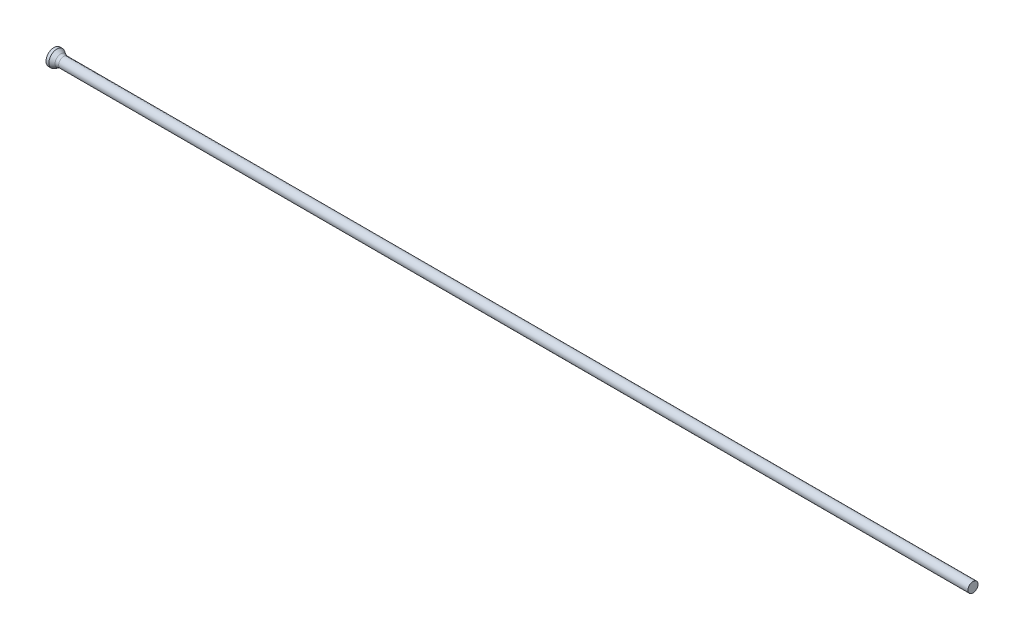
ISO-10303-21;
HEADER;
FILE_DESCRIPTION(('STEP AP214'),'2;1');
FILE_NAME('part.step','',(''),(''),'','','');
FILE_SCHEMA(('AUTOMOTIVE_DESIGN { 1 0 10303 214 1 1 1 1 }'));
ENDSEC;
DATA;
#1=APPLICATION_CONTEXT('core data for automotive mechanical design processes');
#2=APPLICATION_PROTOCOL_DEFINITION('international standard','automotive_design',2000,#1);
#3=PRODUCT_CONTEXT('',#1,'mechanical');
#4=PRODUCT('Part','Part','',(#3));
#5=PRODUCT_RELATED_PRODUCT_CATEGORY('part','',(#4));
#6=PRODUCT_DEFINITION_FORMATION('','',#4);
#7=PRODUCT_DEFINITION_CONTEXT('part definition',#1,'design');
#8=PRODUCT_DEFINITION('design','',#6,#7);
#9=PRODUCT_DEFINITION_SHAPE('','',#8);
#10=(LENGTH_UNIT() NAMED_UNIT(*) SI_UNIT(.MILLI.,.METRE.));
#11=(NAMED_UNIT(*) PLANE_ANGLE_UNIT() SI_UNIT($,.RADIAN.));
#12=(NAMED_UNIT(*) SI_UNIT($,.STERADIAN.) SOLID_ANGLE_UNIT());
#13=UNCERTAINTY_MEASURE_WITH_UNIT(LENGTH_MEASURE(1.E-05),#10,'distance_accuracy_value','');
#14=(GEOMETRIC_REPRESENTATION_CONTEXT(3) GLOBAL_UNCERTAINTY_ASSIGNED_CONTEXT((#13)) GLOBAL_UNIT_ASSIGNED_CONTEXT((#10,
#11,#12)) REPRESENTATION_CONTEXT('',''));
#15=CARTESIAN_POINT('',(0.,0.,0.));
#16=DIRECTION('',(0.,0.,1.));
#17=DIRECTION('',(1.,0.,0.));
#18=AXIS2_PLACEMENT_3D('',#15,#16,#17);
#19=CARTESIAN_POINT('',(0.,0.,0.));
#20=DIRECTION('',(1.,0.,0.));
#21=DIRECTION('',(0.,0.,-1.));
#22=AXIS2_PLACEMENT_3D('',#19,#20,#21);
#23=PLANE('',#22);
#24=CARTESIAN_POINT('',(0.,0.,0.));
#25=DIRECTION('',(-1.,0.,0.));
#26=DIRECTION('',(0.,0.,1.));
#27=AXIS2_PLACEMENT_3D('',#24,#25,#26);
#28=CIRCLE('',#27,1.4);
#29=CARTESIAN_POINT('',(0.,0.,1.4));
#30=VERTEX_POINT('',#29);
#31=EDGE_CURVE('E25',#30,#30,#28,.T.);
#32=ORIENTED_EDGE('',*,*,#31,.T.);
#33=EDGE_LOOP('',(#32));
#34=FACE_BOUND('',#33,.T.);
#35=ADVANCED_FACE('F14',(#34),#23,.F.);
#36=CARTESIAN_POINT('',(0.,0.,0.));
#37=DIRECTION('',(-1.,0.,0.));
#38=DIRECTION('',(0.,0.,1.));
#39=AXIS2_PLACEMENT_3D('',#36,#37,#38);
#40=CYLINDRICAL_SURFACE('',#39,1.4);
#41=ORIENTED_EDGE('',*,*,#31,.F.);
#42=EDGE_LOOP('',(#41));
#43=FACE_BOUND('',#42,.T.);
#44=CARTESIAN_POINT('',(0.500673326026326,0.,0.));
#45=DIRECTION('',(-1.,0.,0.));
#46=DIRECTION('',(0.,0.,1.));
#47=AXIS2_PLACEMENT_3D('',#44,#45,#46);
#48=CIRCLE('',#47,1.4);
#49=CARTESIAN_POINT('',(0.500673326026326,0.,1.4));
#50=VERTEX_POINT('',#49);
#51=EDGE_CURVE('E29',#50,#50,#48,.T.);
#52=ORIENTED_EDGE('',*,*,#51,.T.);
#53=EDGE_LOOP('',(#52));
#54=FACE_BOUND('',#53,.T.);
#55=ADVANCED_FACE('F53',(#43,#54),#40,.T.);
#56=CARTESIAN_POINT('',(1.41,0.,0.));
#57=DIRECTION('',(-1.,0.,0.));
#58=DIRECTION('',(0.,0.,1.));
#59=AXIS2_PLACEMENT_3D('',#56,#57,#58);
#60=CONICAL_SURFACE('',#59,0.875,0.523598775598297);
#61=CARTESIAN_POINT('',(1.17794919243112,0.,0.));
#62=DIRECTION('',(-1.,0.,0.));
#63=DIRECTION('',(0.,0.,1.));
#64=AXIS2_PLACEMENT_3D('',#61,#62,#63);
#65=CIRCLE('',#64,1.00897459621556);
#66=CARTESIAN_POINT('',(1.17794919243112,0.,1.00897459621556));
#67=VERTEX_POINT('',#66);
#68=EDGE_CURVE('E21',#67,#67,#65,.T.);
#69=ORIENTED_EDGE('',*,*,#68,.T.);
#70=EDGE_LOOP('',(#69));
#71=FACE_BOUND('',#70,.T.);
#72=ORIENTED_EDGE('',*,*,#51,.F.);
#73=EDGE_LOOP('',(#72));
#74=FACE_BOUND('',#73,.T.);
#75=ADVANCED_FACE('F50',(#71,#74),#60,.T.);
#76=CARTESIAN_POINT('',(0.,0.,0.));
#77=DIRECTION('',(-1.,0.,0.));
#78=DIRECTION('',(0.,0.,1.));
#79=AXIS2_PLACEMENT_3D('',#76,#77,#78);
#80=CYLINDRICAL_SURFACE('',#79,0.875);
#81=CARTESIAN_POINT('',(1.67794919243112,0.,0.));
#82=DIRECTION('',(-1.,0.,0.));
#83=DIRECTION('',(0.,0.,1.));
#84=AXIS2_PLACEMENT_3D('',#81,#82,#83);
#85=CIRCLE('',#84,0.875);
#86=CARTESIAN_POINT('',(1.67794919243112,0.,0.875));
#87=VERTEX_POINT('',#86);
#88=EDGE_CURVE('E9',#87,#87,#85,.F.);
#89=ORIENTED_EDGE('',*,*,#88,.T.);
#90=EDGE_LOOP('',(#89));
#91=FACE_BOUND('',#90,.T.);
#92=CARTESIAN_POINT('',(160.,0.,0.));
#93=DIRECTION('',(-1.,0.,0.));
#94=DIRECTION('',(0.,0.,1.));
#95=AXIS2_PLACEMENT_3D('',#92,#93,#94);
#96=CIRCLE('',#95,0.875);
#97=CARTESIAN_POINT('',(160.,0.,0.875));
#98=VERTEX_POINT('',#97);
#99=EDGE_CURVE('E34',#98,#98,#96,.T.);
#100=ORIENTED_EDGE('',*,*,#99,.T.);
#101=EDGE_LOOP('',(#100));
#102=FACE_BOUND('',#101,.T.);
#103=ADVANCED_FACE('F38',(#91,#102),#80,.T.);
#104=CARTESIAN_POINT('',(160.,0.875,0.));
#105=DIRECTION('',(-1.,0.,0.));
#106=DIRECTION('',(0.,0.,1.));
#107=AXIS2_PLACEMENT_3D('',#104,#105,#106);
#108=PLANE('',#107);
#109=ORIENTED_EDGE('',*,*,#99,.F.);
#110=EDGE_LOOP('',(#109));
#111=FACE_BOUND('',#110,.T.);
#112=ADVANCED_FACE('F40',(#111),#108,.F.);
#113=CARTESIAN_POINT('',(1.67794919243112,0.,0.));
#114=DIRECTION('',(-1.,0.,0.));
#115=DIRECTION('',(0.,0.,1.));
#116=AXIS2_PLACEMENT_3D('',#113,#114,#115);
#117=TOROIDAL_SURFACE('',#116,1.875,1.);
#118=ORIENTED_EDGE('',*,*,#88,.F.);
#119=EDGE_LOOP('',(#118));
#120=FACE_BOUND('',#119,.T.);
#121=ORIENTED_EDGE('',*,*,#68,.F.);
#122=EDGE_LOOP('',(#121));
#123=FACE_BOUND('',#122,.T.);
#124=ADVANCED_FACE('F16',(#120,#123),#117,.F.);
#125=CLOSED_SHELL('',(#35,#55,#75,#103,#112,#124));
#126=MANIFOLD_SOLID_BREP('B1',#125);
#127=ADVANCED_BREP_SHAPE_REPRESENTATION('',(#18,#126),#14);
#128=SHAPE_DEFINITION_REPRESENTATION(#9,#127);
ENDSEC;
END-ISO-10303-21;
